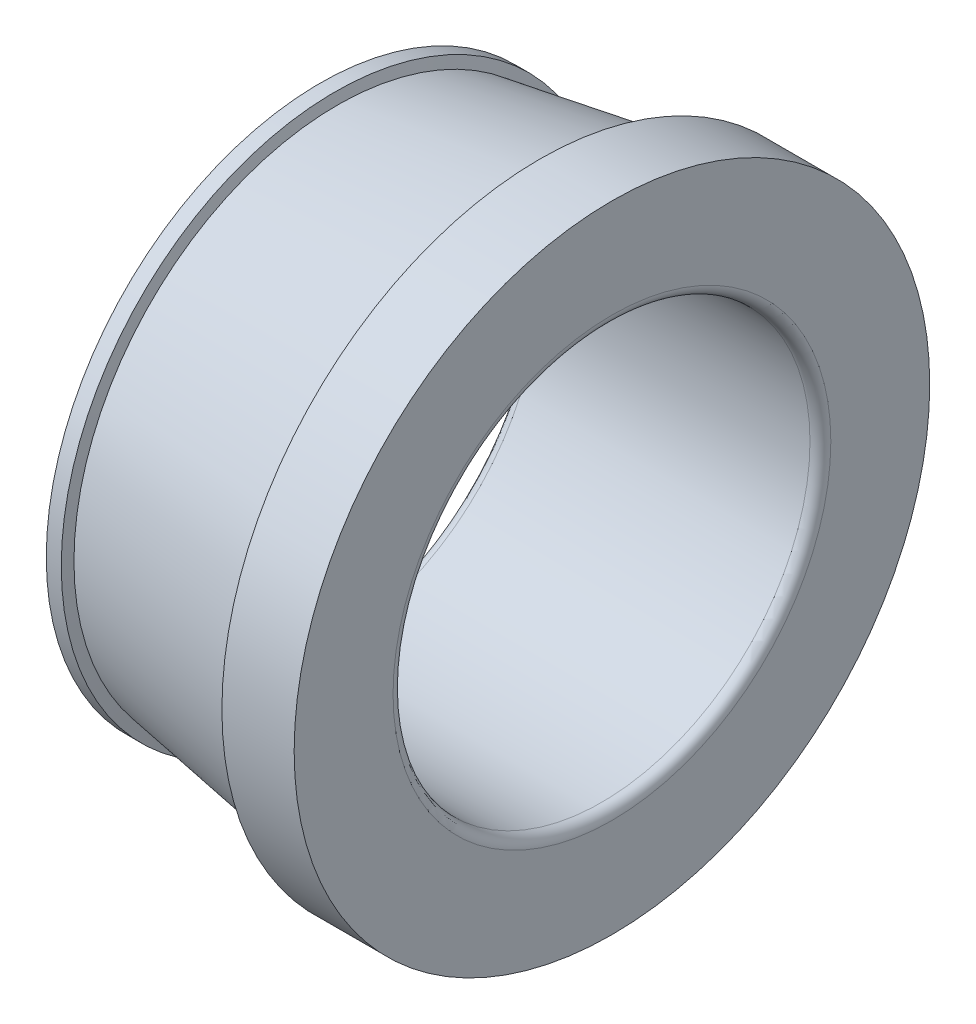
ISO-10303-21;
HEADER;
FILE_DESCRIPTION(('STEP AP214'),'2;1');
FILE_NAME('part.step','',(''),(''),'','','');
FILE_SCHEMA(('AUTOMOTIVE_DESIGN { 1 0 10303 214 1 1 1 1 }'));
ENDSEC;
DATA;
#1=APPLICATION_CONTEXT('core data for automotive mechanical design processes');
#2=APPLICATION_PROTOCOL_DEFINITION('international standard','automotive_design',2000,#1);
#3=PRODUCT_CONTEXT('',#1,'mechanical');
#4=PRODUCT('Part','Part','',(#3));
#5=PRODUCT_RELATED_PRODUCT_CATEGORY('part','',(#4));
#6=PRODUCT_DEFINITION_FORMATION('','',#4);
#7=PRODUCT_DEFINITION_CONTEXT('part definition',#1,'design');
#8=PRODUCT_DEFINITION('design','',#6,#7);
#9=PRODUCT_DEFINITION_SHAPE('','',#8);
#10=(LENGTH_UNIT() NAMED_UNIT(*) SI_UNIT(.MILLI.,.METRE.));
#11=(NAMED_UNIT(*) PLANE_ANGLE_UNIT() SI_UNIT($,.RADIAN.));
#12=(NAMED_UNIT(*) SI_UNIT($,.STERADIAN.) SOLID_ANGLE_UNIT());
#13=UNCERTAINTY_MEASURE_WITH_UNIT(LENGTH_MEASURE(1.E-05),#10,'distance_accuracy_value','');
#14=(GEOMETRIC_REPRESENTATION_CONTEXT(3) GLOBAL_UNCERTAINTY_ASSIGNED_CONTEXT((#13)) GLOBAL_UNIT_ASSIGNED_CONTEXT((#10,
#11,#12)) REPRESENTATION_CONTEXT('',''));
#15=CARTESIAN_POINT('',(0.,0.,0.));
#16=DIRECTION('',(0.,0.,1.));
#17=DIRECTION('',(1.,0.,0.));
#18=AXIS2_PLACEMENT_3D('',#15,#16,#17);
#19=CARTESIAN_POINT('',(1.75,0.,0.));
#20=DIRECTION('',(-1.,0.,0.));
#21=DIRECTION('',(0.,0.,1.));
#22=AXIS2_PLACEMENT_3D('',#19,#20,#21);
#23=TOROIDAL_SURFACE('',#22,10.5,0.500000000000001);
#24=CARTESIAN_POINT('',(1.75,0.,0.));
#25=DIRECTION('',(-1.,0.,0.));
#26=DIRECTION('',(0.,0.,1.));
#27=AXIS2_PLACEMENT_3D('',#24,#25,#26);
#28=CIRCLE('',#27,10.);
#29=CARTESIAN_POINT('',(1.75,0.,10.));
#30=VERTEX_POINT('',#29);
#31=EDGE_CURVE('E10',#30,#30,#28,.T.);
#32=ORIENTED_EDGE('',*,*,#31,.F.);
#33=EDGE_LOOP('',(#32));
#34=FACE_BOUND('',#33,.T.);
#35=CARTESIAN_POINT('',(1.25,0.,0.));
#36=DIRECTION('',(-1.,0.,0.));
#37=DIRECTION('',(0.,0.,1.));
#38=AXIS2_PLACEMENT_3D('',#35,#36,#37);
#39=CIRCLE('',#38,10.5);
#40=CARTESIAN_POINT('',(1.25,0.,10.5));
#41=VERTEX_POINT('',#40);
#42=EDGE_CURVE('E63',#41,#41,#39,.T.);
#43=ORIENTED_EDGE('',*,*,#42,.T.);
#44=EDGE_LOOP('',(#43));
#45=FACE_BOUND('',#44,.T.);
#46=ADVANCED_FACE('F29',(#34,#45),#23,.T.);
#47=CARTESIAN_POINT('',(0.,0.,0.));
#48=DIRECTION('',(-1.,0.,0.));
#49=DIRECTION('',(0.,0.,1.));
#50=AXIS2_PLACEMENT_3D('',#47,#48,#49);
#51=CYLINDRICAL_SURFACE('',#50,10.);
#52=CARTESIAN_POINT('',(14.75,0.,0.));
#53=DIRECTION('',(-1.,0.,0.));
#54=DIRECTION('',(0.,0.,1.));
#55=AXIS2_PLACEMENT_3D('',#52,#53,#54);
#56=CIRCLE('',#55,10.);
#57=CARTESIAN_POINT('',(14.75,0.,10.));
#58=VERTEX_POINT('',#57);
#59=EDGE_CURVE('E35',#58,#58,#56,.T.);
#60=ORIENTED_EDGE('',*,*,#59,.F.);
#61=EDGE_LOOP('',(#60));
#62=FACE_BOUND('',#61,.T.);
#63=ORIENTED_EDGE('',*,*,#31,.T.);
#64=EDGE_LOOP('',(#63));
#65=FACE_BOUND('',#64,.T.);
#66=ADVANCED_FACE('F112',(#62,#65),#51,.F.);
#67=CARTESIAN_POINT('',(14.75,0.,0.));
#68=DIRECTION('',(-1.,0.,0.));
#69=DIRECTION('',(0.,0.,1.));
#70=AXIS2_PLACEMENT_3D('',#67,#68,#69);
#71=TOROIDAL_SURFACE('',#70,10.5,0.5);
#72=CARTESIAN_POINT('',(15.25,0.,0.));
#73=DIRECTION('',(-1.,0.,0.));
#74=DIRECTION('',(0.,0.,1.));
#75=AXIS2_PLACEMENT_3D('',#72,#73,#74);
#76=CIRCLE('',#75,10.5);
#77=CARTESIAN_POINT('',(15.25,0.,10.5));
#78=VERTEX_POINT('',#77);
#79=EDGE_CURVE('E39',#78,#78,#76,.T.);
#80=ORIENTED_EDGE('',*,*,#79,.F.);
#81=EDGE_LOOP('',(#80));
#82=FACE_BOUND('',#81,.T.);
#83=ORIENTED_EDGE('',*,*,#59,.T.);
#84=EDGE_LOOP('',(#83));
#85=FACE_BOUND('',#84,.T.);
#86=ADVANCED_FACE('F107',(#82,#85),#71,.T.);
#87=CARTESIAN_POINT('',(15.25,0.,-15.2436958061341));
#88=DIRECTION('',(-1.,0.,0.));
#89=DIRECTION('',(0.,0.,1.));
#90=AXIS2_PLACEMENT_3D('',#87,#88,#89);
#91=PLANE('',#90);
#92=CARTESIAN_POINT('',(15.25,0.,0.));
#93=DIRECTION('',(-1.,0.,0.));
#94=DIRECTION('',(0.,0.,1.));
#95=AXIS2_PLACEMENT_3D('',#92,#93,#94);
#96=CIRCLE('',#95,15.2436958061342);
#97=CARTESIAN_POINT('',(15.25,0.,15.2436958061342));
#98=VERTEX_POINT('',#97);
#99=EDGE_CURVE('E43',#98,#98,#96,.T.);
#100=ORIENTED_EDGE('',*,*,#99,.F.);
#101=EDGE_LOOP('',(#100));
#102=FACE_BOUND('',#101,.T.);
#103=ORIENTED_EDGE('',*,*,#79,.T.);
#104=EDGE_LOOP('',(#103));
#105=FACE_BOUND('',#104,.T.);
#106=ADVANCED_FACE('F101',(#102,#105),#91,.F.);
#107=CARTESIAN_POINT('',(0.,0.,0.));
#108=DIRECTION('',(-1.,0.,0.));
#109=DIRECTION('',(0.,0.,1.));
#110=AXIS2_PLACEMENT_3D('',#107,#108,#109);
#111=CYLINDRICAL_SURFACE('',#110,15.2436958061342);
#112=CARTESIAN_POINT('',(11.7835820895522,0.,0.));
#113=DIRECTION('',(-1.,0.,0.));
#114=DIRECTION('',(0.,0.,1.));
#115=AXIS2_PLACEMENT_3D('',#112,#113,#114);
#116=CIRCLE('',#115,15.2436958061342);
#117=CARTESIAN_POINT('',(11.7835820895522,0.,15.2436958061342));
#118=VERTEX_POINT('',#117);
#119=EDGE_CURVE('E48',#118,#118,#116,.T.);
#120=ORIENTED_EDGE('',*,*,#119,.F.);
#121=EDGE_LOOP('',(#120));
#122=FACE_BOUND('',#121,.T.);
#123=ORIENTED_EDGE('',*,*,#99,.T.);
#124=EDGE_LOOP('',(#123));
#125=FACE_BOUND('',#124,.T.);
#126=ADVANCED_FACE('F95',(#122,#125),#111,.T.);
#127=CARTESIAN_POINT('',(11.7835820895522,0.,0.));
#128=DIRECTION('',(-1.,0.,0.));
#129=DIRECTION('',(0.,0.,1.));
#130=AXIS2_PLACEMENT_3D('',#127,#128,#129);
#131=CONICAL_SURFACE('',#130,15.2436958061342,1.35766529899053);
#132=CARTESIAN_POINT('',(12.,0.,0.));
#133=DIRECTION('',(-1.,0.,0.));
#134=DIRECTION('',(0.,0.,1.));
#135=AXIS2_PLACEMENT_3D('',#132,#133,#134);
#136=CIRCLE('',#135,14.2436958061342);
#137=CARTESIAN_POINT('',(12.,0.,14.2436958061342));
#138=VERTEX_POINT('',#137);
#139=EDGE_CURVE('E51',#138,#138,#136,.T.);
#140=ORIENTED_EDGE('',*,*,#139,.F.);
#141=EDGE_LOOP('',(#140));
#142=FACE_BOUND('',#141,.T.);
#143=ORIENTED_EDGE('',*,*,#119,.T.);
#144=EDGE_LOOP('',(#143));
#145=FACE_BOUND('',#144,.T.);
#146=ADVANCED_FACE('F89',(#142,#145),#131,.F.);
#147=CARTESIAN_POINT('',(12.,0.,0.));
#148=DIRECTION('',(1.,0.,0.));
#149=DIRECTION('',(0.,0.,-1.));
#150=AXIS2_PLACEMENT_3D('',#147,#148,#149);
#151=CONICAL_SURFACE('',#150,14.2436958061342,0.160771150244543);
#152=CARTESIAN_POINT('',(2.07764586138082,0.,0.));
#153=DIRECTION('',(-1.,0.,0.));
#154=DIRECTION('',(0.,0.,1.));
#155=AXIS2_PLACEMENT_3D('',#152,#153,#154);
#156=CIRCLE('',#155,12.6345797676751);
#157=CARTESIAN_POINT('',(2.07764586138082,0.,12.6345797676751));
#158=VERTEX_POINT('',#157);
#159=EDGE_CURVE('E54',#158,#158,#156,.T.);
#160=ORIENTED_EDGE('',*,*,#159,.F.);
#161=EDGE_LOOP('',(#160));
#162=FACE_BOUND('',#161,.T.);
#163=ORIENTED_EDGE('',*,*,#139,.T.);
#164=EDGE_LOOP('',(#163));
#165=FACE_BOUND('',#164,.T.);
#166=ADVANCED_FACE('F83',(#162,#165),#151,.T.);
#167=CARTESIAN_POINT('',(2.07764586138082,0.,0.));
#168=DIRECTION('',(-1.,0.,0.));
#169=DIRECTION('',(0.,0.,1.));
#170=AXIS2_PLACEMENT_3D('',#167,#168,#169);
#171=CONICAL_SURFACE('',#170,12.6345797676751,1.35766529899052);
#172=CARTESIAN_POINT('',(1.96943690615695,0.,0.));
#173=DIRECTION('',(-1.,0.,0.));
#174=DIRECTION('',(0.,0.,1.));
#175=AXIS2_PLACEMENT_3D('',#172,#173,#174);
#176=CIRCLE('',#175,13.1345797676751);
#177=CARTESIAN_POINT('',(1.96943690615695,0.,13.1345797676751));
#178=VERTEX_POINT('',#177);
#179=EDGE_CURVE('E57',#178,#178,#176,.T.);
#180=ORIENTED_EDGE('',*,*,#179,.F.);
#181=EDGE_LOOP('',(#180));
#182=FACE_BOUND('',#181,.T.);
#183=ORIENTED_EDGE('',*,*,#159,.T.);
#184=EDGE_LOOP('',(#183));
#185=FACE_BOUND('',#184,.T.);
#186=ADVANCED_FACE('F77',(#182,#185),#171,.T.);
#187=CARTESIAN_POINT('',(0.,0.,0.));
#188=DIRECTION('',(-1.,0.,0.));
#189=DIRECTION('',(0.,0.,1.));
#190=AXIS2_PLACEMENT_3D('',#187,#188,#189);
#191=CYLINDRICAL_SURFACE('',#190,13.1345797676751);
#192=CARTESIAN_POINT('',(1.25,0.,0.));
#193=DIRECTION('',(-1.,0.,0.));
#194=DIRECTION('',(0.,0.,1.));
#195=AXIS2_PLACEMENT_3D('',#192,#193,#194);
#196=CIRCLE('',#195,13.1345797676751);
#197=CARTESIAN_POINT('',(1.25,0.,13.1345797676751));
#198=VERTEX_POINT('',#197);
#199=EDGE_CURVE('E60',#198,#198,#196,.T.);
#200=ORIENTED_EDGE('',*,*,#199,.F.);
#201=EDGE_LOOP('',(#200));
#202=FACE_BOUND('',#201,.T.);
#203=ORIENTED_EDGE('',*,*,#179,.T.);
#204=EDGE_LOOP('',(#203));
#205=FACE_BOUND('',#204,.T.);
#206=ADVANCED_FACE('F71',(#202,#205),#191,.T.);
#207=CARTESIAN_POINT('',(1.25,0.,-10.5));
#208=DIRECTION('',(1.,0.,0.));
#209=DIRECTION('',(0.,0.,-1.));
#210=AXIS2_PLACEMENT_3D('',#207,#208,#209);
#211=PLANE('',#210);
#212=ORIENTED_EDGE('',*,*,#42,.F.);
#213=EDGE_LOOP('',(#212));
#214=FACE_BOUND('',#213,.T.);
#215=ORIENTED_EDGE('',*,*,#199,.T.);
#216=EDGE_LOOP('',(#215));
#217=FACE_BOUND('',#216,.T.);
#218=ADVANCED_FACE('F68',(#214,#217),#211,.F.);
#219=CLOSED_SHELL('',(#46,#66,#86,#106,#126,#146,#166,#186,#206,#218));
#220=MANIFOLD_SOLID_BREP('B2',#219);
#221=ADVANCED_BREP_SHAPE_REPRESENTATION('',(#18,#220),#14);
#222=SHAPE_DEFINITION_REPRESENTATION(#9,#221);
ENDSEC;
END-ISO-10303-21;
